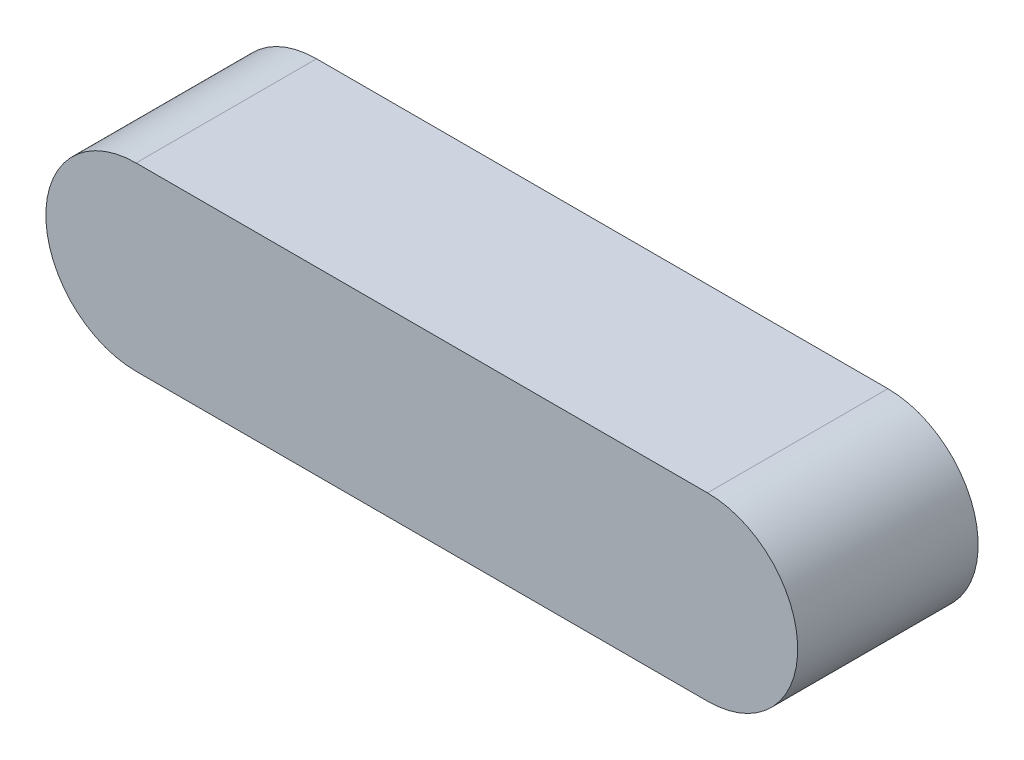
ISO-10303-21;
HEADER;
FILE_DESCRIPTION(('STEP AP214'),'2;1');
FILE_NAME('part.step','',(''),(''),'','','');
FILE_SCHEMA(('AUTOMOTIVE_DESIGN { 1 0 10303 214 1 1 1 1 }'));
ENDSEC;
DATA;
#1=APPLICATION_CONTEXT('core data for automotive mechanical design processes');
#2=APPLICATION_PROTOCOL_DEFINITION('international standard','automotive_design',2000,#1);
#3=PRODUCT_CONTEXT('',#1,'mechanical');
#4=PRODUCT('Part','Part','',(#3));
#5=PRODUCT_RELATED_PRODUCT_CATEGORY('part','',(#4));
#6=PRODUCT_DEFINITION_FORMATION('','',#4);
#7=PRODUCT_DEFINITION_CONTEXT('part definition',#1,'design');
#8=PRODUCT_DEFINITION('design','',#6,#7);
#9=PRODUCT_DEFINITION_SHAPE('','',#8);
#10=(LENGTH_UNIT() NAMED_UNIT(*) SI_UNIT(.MILLI.,.METRE.));
#11=(NAMED_UNIT(*) PLANE_ANGLE_UNIT() SI_UNIT($,.RADIAN.));
#12=(NAMED_UNIT(*) SI_UNIT($,.STERADIAN.) SOLID_ANGLE_UNIT());
#13=UNCERTAINTY_MEASURE_WITH_UNIT(LENGTH_MEASURE(1.E-05),#10,'distance_accuracy_value','');
#14=(GEOMETRIC_REPRESENTATION_CONTEXT(3) GLOBAL_UNCERTAINTY_ASSIGNED_CONTEXT((#13)) GLOBAL_UNIT_ASSIGNED_CONTEXT((#10,
#11,#12)) REPRESENTATION_CONTEXT('',''));
#15=CARTESIAN_POINT('',(0.,0.,0.));
#16=DIRECTION('',(0.,0.,1.));
#17=DIRECTION('',(1.,0.,0.));
#18=AXIS2_PLACEMENT_3D('',#15,#16,#17);
#19=CARTESIAN_POINT('',(70.,0.,6.00000000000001));
#20=DIRECTION('',(0.,0.,-1.));
#21=DIRECTION('',(-1.,0.,0.));
#22=AXIS2_PLACEMENT_3D('',#19,#20,#21);
#23=CYLINDRICAL_SURFACE('',#22,3.);
#24=CARTESIAN_POINT('',(70.,0.,0.));
#25=DIRECTION('',(0.,0.,1.));
#26=DIRECTION('',(1.,0.,0.));
#27=AXIS2_PLACEMENT_3D('',#24,#25,#26);
#28=CIRCLE('',#27,3.);
#29=CARTESIAN_POINT('',(70.,2.99999999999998,0.));
#30=VERTEX_POINT('',#29);
#31=CARTESIAN_POINT('',(70.,-3.00000000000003,0.));
#32=VERTEX_POINT('',#31);
#33=EDGE_CURVE('E96',#30,#32,#28,.T.);
#34=ORIENTED_EDGE('',*,*,#33,.T.);
#35=DIRECTION('',(0.,0.,-1.));
#36=VECTOR('',#35,1.);
#37=CARTESIAN_POINT('',(70.,-3.00000000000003,5.99999999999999));
#38=LINE('',#37,#36);
#39=CARTESIAN_POINT('',(70.,-3.00000000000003,5.99999999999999));
#40=VERTEX_POINT('',#39);
#41=EDGE_CURVE('E11',#40,#32,#38,.T.);
#42=ORIENTED_EDGE('',*,*,#41,.F.);
#43=CARTESIAN_POINT('',(70.,0.,6.00000000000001));
#44=DIRECTION('',(0.,0.,1.));
#45=DIRECTION('',(1.,0.,0.));
#46=AXIS2_PLACEMENT_3D('',#43,#44,#45);
#47=CIRCLE('',#46,3.);
#48=CARTESIAN_POINT('',(70.,2.99999999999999,6.00000000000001));
#49=VERTEX_POINT('',#48);
#50=EDGE_CURVE('E84',#49,#40,#47,.T.);
#51=ORIENTED_EDGE('',*,*,#50,.F.);
#52=DIRECTION('',(0.,0.,-1.));
#53=VECTOR('',#52,1.);
#54=CARTESIAN_POINT('',(70.,2.99999999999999,6.00000000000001));
#55=LINE('',#54,#53);
#56=EDGE_CURVE('E92',#49,#30,#55,.T.);
#57=ORIENTED_EDGE('',*,*,#56,.T.);
#58=EDGE_LOOP('',(#34,#42,#51,#57));
#59=FACE_BOUND('',#58,.T.);
#60=ADVANCED_FACE('F33',(#59),#23,.T.);
#61=CARTESIAN_POINT('',(89.,-3.00000000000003,5.99999999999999));
#62=DIRECTION('',(0.,1.,0.));
#63=DIRECTION('',(0.,0.,1.));
#64=AXIS2_PLACEMENT_3D('',#61,#62,#63);
#65=PLANE('',#64);
#66=DIRECTION('',(1.,0.,0.));
#67=VECTOR('',#66,1.);
#68=CARTESIAN_POINT('',(89.,-3.00000000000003,0.));
#69=LINE('',#68,#67);
#70=CARTESIAN_POINT('',(89.,-3.00000000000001,0.));
#71=VERTEX_POINT('',#70);
#72=EDGE_CURVE('E88',#32,#71,#69,.T.);
#73=ORIENTED_EDGE('',*,*,#72,.T.);
#74=DIRECTION('',(0.,0.,-1.));
#75=VECTOR('',#74,1.);
#76=CARTESIAN_POINT('',(89.,-3.00000000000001,5.99999999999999));
#77=LINE('',#76,#75);
#78=CARTESIAN_POINT('',(89.,-3.00000000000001,5.99999999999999));
#79=VERTEX_POINT('',#78);
#80=EDGE_CURVE('E41',#79,#71,#77,.T.);
#81=ORIENTED_EDGE('',*,*,#80,.F.);
#82=DIRECTION('',(1.,0.,0.));
#83=VECTOR('',#82,1.);
#84=CARTESIAN_POINT('',(89.,-3.00000000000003,5.99999999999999));
#85=LINE('',#84,#83);
#86=EDGE_CURVE('E79',#40,#79,#85,.T.);
#87=ORIENTED_EDGE('',*,*,#86,.F.);
#88=ORIENTED_EDGE('',*,*,#41,.T.);
#89=EDGE_LOOP('',(#73,#81,#87,#88));
#90=FACE_BOUND('',#89,.T.);
#91=ADVANCED_FACE('F87',(#90),#65,.F.);
#92=CARTESIAN_POINT('',(89.,0.,6.00000000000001));
#93=DIRECTION('',(0.,0.,-1.));
#94=DIRECTION('',(-1.,0.,0.));
#95=AXIS2_PLACEMENT_3D('',#92,#93,#94);
#96=CYLINDRICAL_SURFACE('',#95,3.);
#97=CARTESIAN_POINT('',(89.,0.,0.));
#98=DIRECTION('',(0.,0.,1.));
#99=DIRECTION('',(1.,0.,0.));
#100=AXIS2_PLACEMENT_3D('',#97,#98,#99);
#101=CIRCLE('',#100,3.);
#102=CARTESIAN_POINT('',(89.,2.99999999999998,0.));
#103=VERTEX_POINT('',#102);
#104=EDGE_CURVE('E66',#71,#103,#101,.T.);
#105=ORIENTED_EDGE('',*,*,#104,.T.);
#106=DIRECTION('',(0.,0.,-1.));
#107=VECTOR('',#106,1.);
#108=CARTESIAN_POINT('',(89.,2.99999999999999,6.00000000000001));
#109=LINE('',#108,#107);
#110=CARTESIAN_POINT('',(89.,2.99999999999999,6.00000000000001));
#111=VERTEX_POINT('',#110);
#112=EDGE_CURVE('E89',#111,#103,#109,.T.);
#113=ORIENTED_EDGE('',*,*,#112,.F.);
#114=CARTESIAN_POINT('',(89.,0.,6.00000000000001));
#115=DIRECTION('',(0.,0.,1.));
#116=DIRECTION('',(1.,0.,0.));
#117=AXIS2_PLACEMENT_3D('',#114,#115,#116);
#118=CIRCLE('',#117,3.);
#119=EDGE_CURVE('E82',#79,#111,#118,.T.);
#120=ORIENTED_EDGE('',*,*,#119,.F.);
#121=ORIENTED_EDGE('',*,*,#80,.T.);
#122=EDGE_LOOP('',(#105,#113,#120,#121));
#123=FACE_BOUND('',#122,.T.);
#124=ADVANCED_FACE('F90',(#123),#96,.T.);
#125=CARTESIAN_POINT('',(70.,2.99999999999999,6.00000000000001));
#126=DIRECTION('',(0.,-1.,0.));
#127=DIRECTION('',(0.,0.,-1.));
#128=AXIS2_PLACEMENT_3D('',#125,#126,#127);
#129=PLANE('',#128);
#130=DIRECTION('',(-1.,0.,0.));
#131=VECTOR('',#130,1.);
#132=CARTESIAN_POINT('',(70.,2.99999999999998,0.));
#133=LINE('',#132,#131);
#134=EDGE_CURVE('E72',#103,#30,#133,.T.);
#135=ORIENTED_EDGE('',*,*,#134,.T.);
#136=ORIENTED_EDGE('',*,*,#56,.F.);
#137=DIRECTION('',(-1.,0.,0.));
#138=VECTOR('',#137,1.);
#139=CARTESIAN_POINT('',(70.,2.99999999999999,6.00000000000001));
#140=LINE('',#139,#138);
#141=EDGE_CURVE('E49',#111,#49,#140,.T.);
#142=ORIENTED_EDGE('',*,*,#141,.F.);
#143=ORIENTED_EDGE('',*,*,#112,.T.);
#144=EDGE_LOOP('',(#135,#136,#142,#143));
#145=FACE_BOUND('',#144,.T.);
#146=ADVANCED_FACE('F103',(#145),#129,.F.);
#147=CARTESIAN_POINT('',(70.,0.,6.00000000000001));
#148=DIRECTION('',(0.,0.,1.));
#149=DIRECTION('',(1.,0.,0.));
#150=AXIS2_PLACEMENT_3D('',#147,#148,#149);
#151=PLANE('',#150);
#152=ORIENTED_EDGE('',*,*,#50,.T.);
#153=ORIENTED_EDGE('',*,*,#86,.T.);
#154=ORIENTED_EDGE('',*,*,#119,.T.);
#155=ORIENTED_EDGE('',*,*,#141,.T.);
#156=EDGE_LOOP('',(#152,#153,#154,#155));
#157=FACE_BOUND('',#156,.T.);
#158=ADVANCED_FACE('F80',(#157),#151,.T.);
#159=CARTESIAN_POINT('',(70.,0.,0.));
#160=DIRECTION('',(0.,0.,1.));
#161=DIRECTION('',(1.,0.,0.));
#162=AXIS2_PLACEMENT_3D('',#159,#160,#161);
#163=PLANE('',#162);
#164=ORIENTED_EDGE('',*,*,#33,.F.);
#165=ORIENTED_EDGE('',*,*,#134,.F.);
#166=ORIENTED_EDGE('',*,*,#104,.F.);
#167=ORIENTED_EDGE('',*,*,#72,.F.);
#168=EDGE_LOOP('',(#164,#165,#166,#167));
#169=FACE_BOUND('',#168,.T.);
#170=ADVANCED_FACE('F106',(#169),#163,.F.);
#171=CLOSED_SHELL('',(#60,#91,#124,#146,#158,#170));
#172=MANIFOLD_SOLID_BREP('B2',#171);
#173=ADVANCED_BREP_SHAPE_REPRESENTATION('',(#18,#172),#14);
#174=SHAPE_DEFINITION_REPRESENTATION(#9,#173);
ENDSEC;
END-ISO-10303-21;
